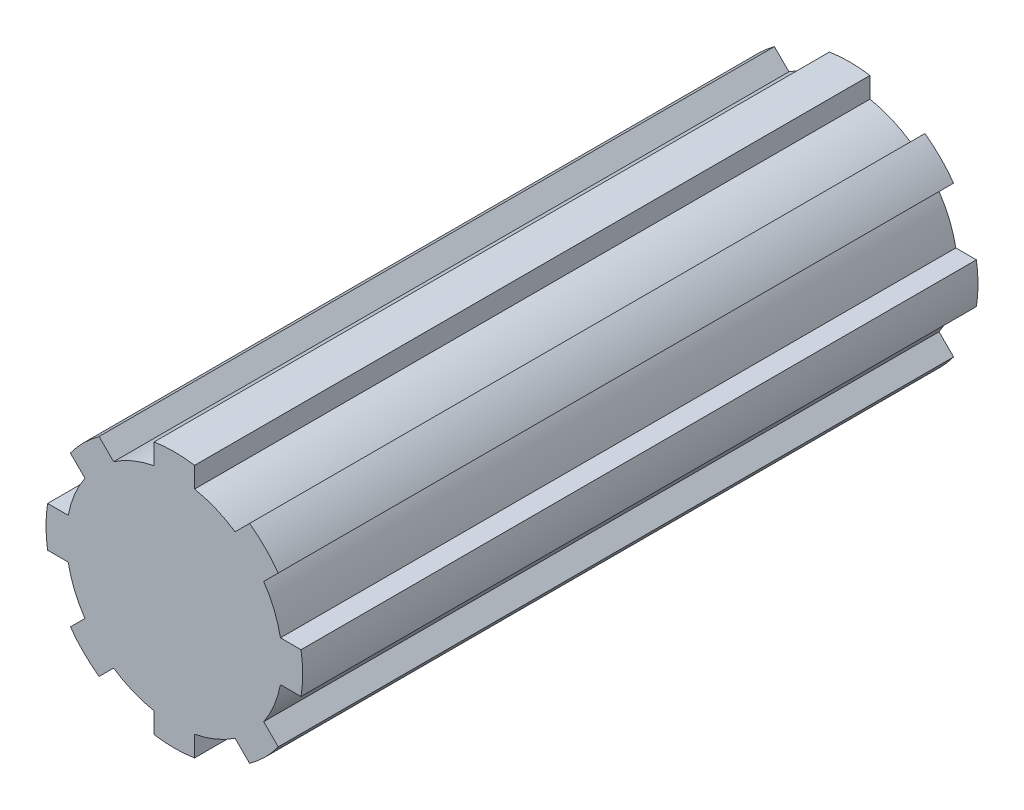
from build123d import *

# Parameters (mm, degrees)
SKETCH1_R          = 16
BASEKEY_DEPTH      = 50
RECTANGLE_DEPTH    = 50
RECTANGLEPAT_COUNT = 8


with BuildPart() as part:
    # Sketch1 → BaseKey (new, symmetric)
    with BuildSketch(Plane.XY):
        Circle(SKETCH1_R)
    extrude(amount=BASEKEY_DEPTH, both=True)

    # Sketch2 → Rectangle (add, symmetric)
    with BuildSketch(Plane.XY):
        with BuildLine():
            Line((-3, 18.761663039), (-3, 0))
            Line((-3, 0), (3, 0))
            Line((3, 0), (3, 18.761663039))
            ThreePointArc((3, 18.761663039), (0, 19), (-3, 18.761663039))
        make_face()
    rectangle = extrude(amount=RECTANGLE_DEPTH, both=True)

    # RectanglePat: Rectangle ×8 about axis
    rectanglepat_axis = Axis((0, 0, 0), (0, 0, 1))
    for i in range(1, RECTANGLEPAT_COUNT):
        add(rectangle.rotate(rectanglepat_axis, i * 360 / RECTANGLEPAT_COUNT))


solid = part.part
